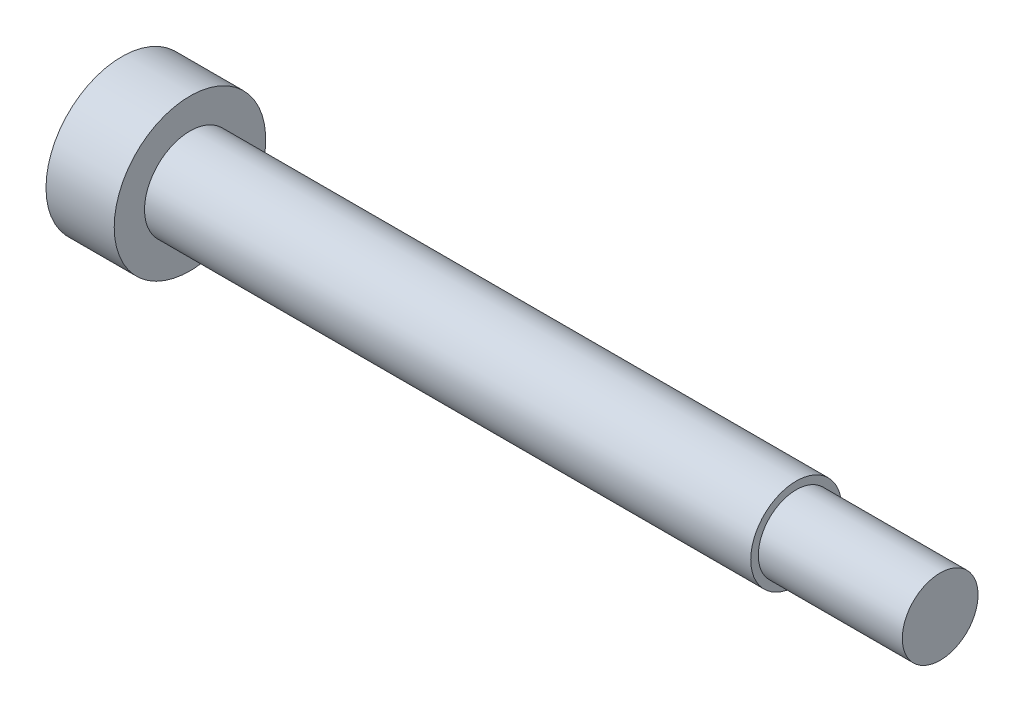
ISO-10303-21;
HEADER;
FILE_DESCRIPTION(('STEP AP214'),'2;1');
FILE_NAME('part.step','',(''),(''),'','','');
FILE_SCHEMA(('AUTOMOTIVE_DESIGN { 1 0 10303 214 1 1 1 1 }'));
ENDSEC;
DATA;
#1=APPLICATION_CONTEXT('core data for automotive mechanical design processes');
#2=APPLICATION_PROTOCOL_DEFINITION('international standard','automotive_design',2000,#1);
#3=PRODUCT_CONTEXT('',#1,'mechanical');
#4=PRODUCT('Part','Part','',(#3));
#5=PRODUCT_RELATED_PRODUCT_CATEGORY('part','',(#4));
#6=PRODUCT_DEFINITION_FORMATION('','',#4);
#7=PRODUCT_DEFINITION_CONTEXT('part definition',#1,'design');
#8=PRODUCT_DEFINITION('design','',#6,#7);
#9=PRODUCT_DEFINITION_SHAPE('','',#8);
#10=(LENGTH_UNIT() NAMED_UNIT(*) SI_UNIT(.MILLI.,.METRE.));
#11=(NAMED_UNIT(*) PLANE_ANGLE_UNIT() SI_UNIT($,.RADIAN.));
#12=(NAMED_UNIT(*) SI_UNIT($,.STERADIAN.) SOLID_ANGLE_UNIT());
#13=UNCERTAINTY_MEASURE_WITH_UNIT(LENGTH_MEASURE(1.E-05),#10,'distance_accuracy_value','');
#14=(GEOMETRIC_REPRESENTATION_CONTEXT(3) GLOBAL_UNCERTAINTY_ASSIGNED_CONTEXT((#13)) GLOBAL_UNIT_ASSIGNED_CONTEXT((#10,
#11,#12)) REPRESENTATION_CONTEXT('',''));
#15=CARTESIAN_POINT('',(0.,0.,0.));
#16=DIRECTION('',(0.,0.,1.));
#17=DIRECTION('',(1.,0.,0.));
#18=AXIS2_PLACEMENT_3D('',#15,#16,#17);
#19=CARTESIAN_POINT('',(0.,0.,0.));
#20=DIRECTION('',(1.,0.,0.));
#21=DIRECTION('',(0.,0.,-1.));
#22=AXIS2_PLACEMENT_3D('',#19,#20,#21);
#23=PLANE('',#22);
#24=DIRECTION('',(0.,0.866025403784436,-0.5));
#25=VECTOR('',#24,1.);
#26=CARTESIAN_POINT('',(0.,0.,2.));
#27=LINE('',#26,#25);
#28=CARTESIAN_POINT('',(0.,0.,2.));
#29=VERTEX_POINT('',#28);
#30=CARTESIAN_POINT('',(0.,1.73205080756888,1.));
#31=VERTEX_POINT('',#30);
#32=EDGE_CURVE('E104',#29,#31,#27,.T.);
#33=ORIENTED_EDGE('',*,*,#32,.F.);
#34=DIRECTION('',(0.,0.866025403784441,0.5));
#35=VECTOR('',#34,1.);
#36=CARTESIAN_POINT('',(0.,-1.73205080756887,1.));
#37=LINE('',#36,#35);
#38=CARTESIAN_POINT('',(0.,-1.73205080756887,1.));
#39=VERTEX_POINT('',#38);
#40=EDGE_CURVE('E30',#39,#29,#37,.T.);
#41=ORIENTED_EDGE('',*,*,#40,.F.);
#42=DIRECTION('',(0.,0.,1.));
#43=VECTOR('',#42,1.);
#44=CARTESIAN_POINT('',(0.,-1.73205080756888,-1.));
#45=LINE('',#44,#43);
#46=CARTESIAN_POINT('',(0.,-1.73205080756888,-1.));
#47=VERTEX_POINT('',#46);
#48=EDGE_CURVE('E113',#47,#39,#45,.T.);
#49=ORIENTED_EDGE('',*,*,#48,.F.);
#50=DIRECTION('',(0.,-0.866025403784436,0.5));
#51=VECTOR('',#50,1.);
#52=CARTESIAN_POINT('',(0.,0.,-2.));
#53=LINE('',#52,#51);
#54=CARTESIAN_POINT('',(0.,0.,-2.));
#55=VERTEX_POINT('',#54);
#56=EDGE_CURVE('E111',#55,#47,#53,.T.);
#57=ORIENTED_EDGE('',*,*,#56,.F.);
#58=DIRECTION('',(0.,-0.866025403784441,-0.5));
#59=VECTOR('',#58,1.);
#60=CARTESIAN_POINT('',(0.,1.73205080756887,-1.));
#61=LINE('',#60,#59);
#62=CARTESIAN_POINT('',(0.,1.73205080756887,-1.));
#63=VERTEX_POINT('',#62);
#64=EDGE_CURVE('E78',#63,#55,#61,.T.);
#65=ORIENTED_EDGE('',*,*,#64,.F.);
#66=DIRECTION('',(0.,0.,-1.));
#67=VECTOR('',#66,1.);
#68=CARTESIAN_POINT('',(0.,1.73205080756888,1.));
#69=LINE('',#68,#67);
#70=EDGE_CURVE('E107',#31,#63,#69,.T.);
#71=ORIENTED_EDGE('',*,*,#70,.F.);
#72=EDGE_LOOP('',(#33,#41,#49,#57,#65,#71));
#73=FACE_BOUND('',#72,.T.);
#74=CARTESIAN_POINT('',(0.,0.,0.));
#75=DIRECTION('',(-1.,0.,0.));
#76=DIRECTION('',(0.,0.,1.));
#77=AXIS2_PLACEMENT_3D('',#74,#75,#76);
#78=CIRCLE('',#77,5.);
#79=CARTESIAN_POINT('',(0.,0.,5.));
#80=VERTEX_POINT('',#79);
#81=EDGE_CURVE('E10',#80,#80,#78,.T.);
#82=ORIENTED_EDGE('',*,*,#81,.T.);
#83=EDGE_LOOP('',(#82));
#84=FACE_BOUND('',#83,.T.);
#85=ADVANCED_FACE('F16',(#73,#84),#23,.F.);
#86=CARTESIAN_POINT('',(0.,0.,0.));
#87=DIRECTION('',(-1.,0.,0.));
#88=DIRECTION('',(0.,0.,1.));
#89=AXIS2_PLACEMENT_3D('',#86,#87,#88);
#90=CYLINDRICAL_SURFACE('',#89,5.);
#91=ORIENTED_EDGE('',*,*,#81,.F.);
#92=EDGE_LOOP('',(#91));
#93=FACE_BOUND('',#92,.T.);
#94=CARTESIAN_POINT('',(4.5,0.,0.));
#95=DIRECTION('',(-1.,0.,0.));
#96=DIRECTION('',(0.,0.,1.));
#97=AXIS2_PLACEMENT_3D('',#94,#95,#96);
#98=CIRCLE('',#97,5.);
#99=CARTESIAN_POINT('',(4.5,0.,5.));
#100=VERTEX_POINT('',#99);
#101=EDGE_CURVE('E23',#100,#100,#98,.T.);
#102=ORIENTED_EDGE('',*,*,#101,.T.);
#103=EDGE_LOOP('',(#102));
#104=FACE_BOUND('',#103,.T.);
#105=ADVANCED_FACE('F136',(#93,#104),#90,.T.);
#106=CARTESIAN_POINT('',(4.5,5.,0.));
#107=DIRECTION('',(-1.,0.,0.));
#108=DIRECTION('',(0.,0.,1.));
#109=AXIS2_PLACEMENT_3D('',#106,#107,#108);
#110=PLANE('',#109);
#111=ORIENTED_EDGE('',*,*,#101,.F.);
#112=EDGE_LOOP('',(#111));
#113=FACE_BOUND('',#112,.T.);
#114=CARTESIAN_POINT('',(4.5,0.,0.));
#115=DIRECTION('',(-1.,0.,0.));
#116=DIRECTION('',(0.,0.,1.));
#117=AXIS2_PLACEMENT_3D('',#114,#115,#116);
#118=CIRCLE('',#117,3.);
#119=CARTESIAN_POINT('',(4.5,0.,3.));
#120=VERTEX_POINT('',#119);
#121=EDGE_CURVE('E131',#120,#120,#118,.T.);
#122=ORIENTED_EDGE('',*,*,#121,.T.);
#123=EDGE_LOOP('',(#122));
#124=FACE_BOUND('',#123,.T.);
#125=ADVANCED_FACE('F138',(#113,#124),#110,.F.);
#126=CARTESIAN_POINT('',(0.,0.,0.));
#127=DIRECTION('',(-1.,0.,0.));
#128=DIRECTION('',(0.,0.,1.));
#129=AXIS2_PLACEMENT_3D('',#126,#127,#128);
#130=CYLINDRICAL_SURFACE('',#129,3.);
#131=ORIENTED_EDGE('',*,*,#121,.F.);
#132=EDGE_LOOP('',(#131));
#133=FACE_BOUND('',#132,.T.);
#134=CARTESIAN_POINT('',(44.5,0.,0.));
#135=DIRECTION('',(-1.,0.,0.));
#136=DIRECTION('',(0.,0.,1.));
#137=AXIS2_PLACEMENT_3D('',#134,#135,#136);
#138=CIRCLE('',#137,3.);
#139=CARTESIAN_POINT('',(44.5,0.,3.));
#140=VERTEX_POINT('',#139);
#141=EDGE_CURVE('E128',#140,#140,#138,.T.);
#142=ORIENTED_EDGE('',*,*,#141,.T.);
#143=EDGE_LOOP('',(#142));
#144=FACE_BOUND('',#143,.T.);
#145=ADVANCED_FACE('F141',(#133,#144),#130,.T.);
#146=CARTESIAN_POINT('',(44.5,3.,0.));
#147=DIRECTION('',(-1.,0.,0.));
#148=DIRECTION('',(0.,0.,1.));
#149=AXIS2_PLACEMENT_3D('',#146,#147,#148);
#150=PLANE('',#149);
#151=ORIENTED_EDGE('',*,*,#141,.F.);
#152=EDGE_LOOP('',(#151));
#153=FACE_BOUND('',#152,.T.);
#154=CARTESIAN_POINT('',(44.5,0.,0.));
#155=DIRECTION('',(-1.,0.,0.));
#156=DIRECTION('',(0.,0.,1.));
#157=AXIS2_PLACEMENT_3D('',#154,#155,#156);
#158=CIRCLE('',#157,2.5);
#159=CARTESIAN_POINT('',(44.5,0.,2.5));
#160=VERTEX_POINT('',#159);
#161=EDGE_CURVE('E125',#160,#160,#158,.T.);
#162=ORIENTED_EDGE('',*,*,#161,.T.);
#163=EDGE_LOOP('',(#162));
#164=FACE_BOUND('',#163,.T.);
#165=ADVANCED_FACE('F147',(#153,#164),#150,.F.);
#166=CARTESIAN_POINT('',(0.,0.,0.));
#167=DIRECTION('',(-1.,0.,0.));
#168=DIRECTION('',(0.,0.,1.));
#169=AXIS2_PLACEMENT_3D('',#166,#167,#168);
#170=CYLINDRICAL_SURFACE('',#169,2.5);
#171=ORIENTED_EDGE('',*,*,#161,.F.);
#172=EDGE_LOOP('',(#171));
#173=FACE_BOUND('',#172,.T.);
#174=CARTESIAN_POINT('',(54.,0.,0.));
#175=DIRECTION('',(-1.,0.,0.));
#176=DIRECTION('',(0.,0.,1.));
#177=AXIS2_PLACEMENT_3D('',#174,#175,#176);
#178=CIRCLE('',#177,2.5);
#179=CARTESIAN_POINT('',(54.,0.,2.5));
#180=VERTEX_POINT('',#179);
#181=EDGE_CURVE('E117',#180,#180,#178,.T.);
#182=ORIENTED_EDGE('',*,*,#181,.T.);
#183=EDGE_LOOP('',(#182));
#184=FACE_BOUND('',#183,.T.);
#185=ADVANCED_FACE('F153',(#173,#184),#170,.T.);
#186=CARTESIAN_POINT('',(54.,2.5,0.));
#187=DIRECTION('',(-1.,0.,0.));
#188=DIRECTION('',(0.,0.,1.));
#189=AXIS2_PLACEMENT_3D('',#186,#187,#188);
#190=PLANE('',#189);
#191=ORIENTED_EDGE('',*,*,#181,.F.);
#192=EDGE_LOOP('',(#191));
#193=FACE_BOUND('',#192,.T.);
#194=ADVANCED_FACE('F159',(#193),#190,.F.);
#195=CARTESIAN_POINT('',(3.,-1.73205080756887,1.));
#196=DIRECTION('',(0.,-0.5,0.866025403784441));
#197=DIRECTION('',(0.,-0.866025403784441,-0.5));
#198=AXIS2_PLACEMENT_3D('',#195,#196,#197);
#199=PLANE('',#198);
#200=ORIENTED_EDGE('',*,*,#40,.T.);
#201=DIRECTION('',(-1.,0.,0.));
#202=VECTOR('',#201,1.);
#203=CARTESIAN_POINT('',(3.,0.,2.));
#204=LINE('',#203,#202);
#205=CARTESIAN_POINT('',(3.,0.,2.));
#206=VERTEX_POINT('',#205);
#207=EDGE_CURVE('E60',#206,#29,#204,.T.);
#208=ORIENTED_EDGE('',*,*,#207,.F.);
#209=DIRECTION('',(0.,0.866025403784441,0.5));
#210=VECTOR('',#209,1.);
#211=CARTESIAN_POINT('',(3.,-1.73205080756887,1.));
#212=LINE('',#211,#210);
#213=CARTESIAN_POINT('',(3.,-1.73205080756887,1.));
#214=VERTEX_POINT('',#213);
#215=EDGE_CURVE('E115',#214,#206,#212,.T.);
#216=ORIENTED_EDGE('',*,*,#215,.F.);
#217=DIRECTION('',(-1.,0.,0.));
#218=VECTOR('',#217,1.);
#219=CARTESIAN_POINT('',(3.,-1.73205080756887,1.));
#220=LINE('',#219,#218);
#221=EDGE_CURVE('E38',#214,#39,#220,.T.);
#222=ORIENTED_EDGE('',*,*,#221,.T.);
#223=EDGE_LOOP('',(#200,#208,#216,#222));
#224=FACE_BOUND('',#223,.T.);
#225=ADVANCED_FACE('F164',(#224),#199,.F.);
#226=CARTESIAN_POINT('',(3.,-1.73205080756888,-1.));
#227=DIRECTION('',(0.,-1.,0.));
#228=DIRECTION('',(0.,0.,-1.));
#229=AXIS2_PLACEMENT_3D('',#226,#227,#228);
#230=PLANE('',#229);
#231=ORIENTED_EDGE('',*,*,#48,.T.);
#232=ORIENTED_EDGE('',*,*,#221,.F.);
#233=DIRECTION('',(0.,0.,1.));
#234=VECTOR('',#233,1.);
#235=CARTESIAN_POINT('',(3.,-1.73205080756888,-1.));
#236=LINE('',#235,#234);
#237=CARTESIAN_POINT('',(3.,-1.73205080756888,-1.));
#238=VERTEX_POINT('',#237);
#239=EDGE_CURVE('E90',#238,#214,#236,.T.);
#240=ORIENTED_EDGE('',*,*,#239,.F.);
#241=DIRECTION('',(-1.,0.,0.));
#242=VECTOR('',#241,1.);
#243=CARTESIAN_POINT('',(3.,-1.73205080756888,-1.));
#244=LINE('',#243,#242);
#245=EDGE_CURVE('E82',#238,#47,#244,.T.);
#246=ORIENTED_EDGE('',*,*,#245,.T.);
#247=EDGE_LOOP('',(#231,#232,#240,#246));
#248=FACE_BOUND('',#247,.T.);
#249=ADVANCED_FACE('F171',(#248),#230,.F.);
#250=CARTESIAN_POINT('',(3.,0.,-2.));
#251=DIRECTION('',(0.,-0.5,-0.866025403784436));
#252=DIRECTION('',(0.,0.866025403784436,-0.5));
#253=AXIS2_PLACEMENT_3D('',#250,#251,#252);
#254=PLANE('',#253);
#255=ORIENTED_EDGE('',*,*,#56,.T.);
#256=ORIENTED_EDGE('',*,*,#245,.F.);
#257=DIRECTION('',(0.,-0.866025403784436,0.5));
#258=VECTOR('',#257,1.);
#259=CARTESIAN_POINT('',(3.,0.,-2.));
#260=LINE('',#259,#258);
#261=CARTESIAN_POINT('',(3.,0.,-2.));
#262=VERTEX_POINT('',#261);
#263=EDGE_CURVE('E86',#262,#238,#260,.T.);
#264=ORIENTED_EDGE('',*,*,#263,.F.);
#265=DIRECTION('',(-1.,0.,0.));
#266=VECTOR('',#265,1.);
#267=CARTESIAN_POINT('',(3.,0.,-2.));
#268=LINE('',#267,#266);
#269=EDGE_CURVE('E71',#262,#55,#268,.T.);
#270=ORIENTED_EDGE('',*,*,#269,.T.);
#271=EDGE_LOOP('',(#255,#256,#264,#270));
#272=FACE_BOUND('',#271,.T.);
#273=ADVANCED_FACE('F87',(#272),#254,.F.);
#274=CARTESIAN_POINT('',(3.,1.73205080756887,-1.));
#275=DIRECTION('',(0.,0.5,-0.866025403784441));
#276=DIRECTION('',(0.,0.866025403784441,0.5));
#277=AXIS2_PLACEMENT_3D('',#274,#275,#276);
#278=PLANE('',#277);
#279=ORIENTED_EDGE('',*,*,#64,.T.);
#280=ORIENTED_EDGE('',*,*,#269,.F.);
#281=DIRECTION('',(0.,-0.866025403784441,-0.5));
#282=VECTOR('',#281,1.);
#283=CARTESIAN_POINT('',(3.,1.73205080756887,-1.));
#284=LINE('',#283,#282);
#285=CARTESIAN_POINT('',(3.,1.73205080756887,-1.));
#286=VERTEX_POINT('',#285);
#287=EDGE_CURVE('E75',#286,#262,#284,.T.);
#288=ORIENTED_EDGE('',*,*,#287,.F.);
#289=DIRECTION('',(-1.,0.,0.));
#290=VECTOR('',#289,1.);
#291=CARTESIAN_POINT('',(3.,1.73205080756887,-1.));
#292=LINE('',#291,#290);
#293=EDGE_CURVE('E83',#286,#63,#292,.T.);
#294=ORIENTED_EDGE('',*,*,#293,.T.);
#295=EDGE_LOOP('',(#279,#280,#288,#294));
#296=FACE_BOUND('',#295,.T.);
#297=ADVANCED_FACE('F73',(#296),#278,.F.);
#298=CARTESIAN_POINT('',(3.,1.73205080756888,1.));
#299=DIRECTION('',(0.,1.,0.));
#300=DIRECTION('',(0.,0.,1.));
#301=AXIS2_PLACEMENT_3D('',#298,#299,#300);
#302=PLANE('',#301);
#303=ORIENTED_EDGE('',*,*,#70,.T.);
#304=ORIENTED_EDGE('',*,*,#293,.F.);
#305=DIRECTION('',(0.,0.,-1.));
#306=VECTOR('',#305,1.);
#307=CARTESIAN_POINT('',(3.,1.73205080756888,1.));
#308=LINE('',#307,#306);
#309=CARTESIAN_POINT('',(3.,1.73205080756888,1.));
#310=VERTEX_POINT('',#309);
#311=EDGE_CURVE('E96',#310,#286,#308,.T.);
#312=ORIENTED_EDGE('',*,*,#311,.F.);
#313=DIRECTION('',(-1.,0.,0.));
#314=VECTOR('',#313,1.);
#315=CARTESIAN_POINT('',(3.,1.73205080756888,1.));
#316=LINE('',#315,#314);
#317=EDGE_CURVE('E120',#310,#31,#316,.T.);
#318=ORIENTED_EDGE('',*,*,#317,.T.);
#319=EDGE_LOOP('',(#303,#304,#312,#318));
#320=FACE_BOUND('',#319,.T.);
#321=ADVANCED_FACE('F199',(#320),#302,.F.);
#322=CARTESIAN_POINT('',(3.,0.,2.));
#323=DIRECTION('',(0.,0.5,0.866025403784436));
#324=DIRECTION('',(0.,-0.866025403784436,0.5));
#325=AXIS2_PLACEMENT_3D('',#322,#323,#324);
#326=PLANE('',#325);
#327=ORIENTED_EDGE('',*,*,#32,.T.);
#328=ORIENTED_EDGE('',*,*,#317,.F.);
#329=DIRECTION('',(0.,0.866025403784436,-0.5));
#330=VECTOR('',#329,1.);
#331=CARTESIAN_POINT('',(3.,0.,2.));
#332=LINE('',#331,#330);
#333=EDGE_CURVE('E98',#206,#310,#332,.T.);
#334=ORIENTED_EDGE('',*,*,#333,.F.);
#335=ORIENTED_EDGE('',*,*,#207,.T.);
#336=EDGE_LOOP('',(#327,#328,#334,#335));
#337=FACE_BOUND('',#336,.T.);
#338=ADVANCED_FACE('F186',(#337),#326,.F.);
#339=CARTESIAN_POINT('',(3.,0.,0.));
#340=DIRECTION('',(-1.,0.,0.));
#341=DIRECTION('',(0.,0.,1.));
#342=AXIS2_PLACEMENT_3D('',#339,#340,#341);
#343=PLANE('',#342);
#344=ORIENTED_EDGE('',*,*,#215,.T.);
#345=ORIENTED_EDGE('',*,*,#333,.T.);
#346=ORIENTED_EDGE('',*,*,#311,.T.);
#347=ORIENTED_EDGE('',*,*,#287,.T.);
#348=ORIENTED_EDGE('',*,*,#263,.T.);
#349=ORIENTED_EDGE('',*,*,#239,.T.);
#350=EDGE_LOOP('',(#344,#345,#346,#347,#348,#349));
#351=FACE_BOUND('',#350,.T.);
#352=ADVANCED_FACE('F93',(#351),#343,.T.);
#353=CLOSED_SHELL('',(#85,#105,#125,#145,#165,#185,#194,#225,#249,#273,#297,#321,#338,#352));
#354=MANIFOLD_SOLID_BREP('B1',#353);
#355=ADVANCED_BREP_SHAPE_REPRESENTATION('',(#18,#354),#14);
#356=SHAPE_DEFINITION_REPRESENTATION(#9,#355);
ENDSEC;
END-ISO-10303-21;
